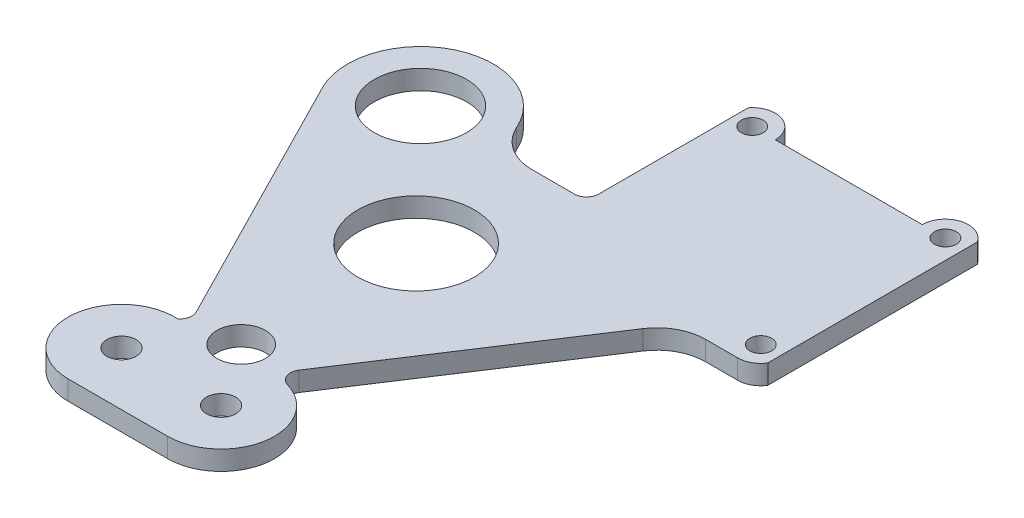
ISO-10303-21;
HEADER;
FILE_DESCRIPTION(('STEP AP214'),'2;1');
FILE_NAME('part.step','',(''),(''),'','','');
FILE_SCHEMA(('AUTOMOTIVE_DESIGN { 1 0 10303 214 1 1 1 1 }'));
ENDSEC;
DATA;
#1=APPLICATION_CONTEXT('core data for automotive mechanical design processes');
#2=APPLICATION_PROTOCOL_DEFINITION('international standard','automotive_design',2000,#1);
#3=PRODUCT_CONTEXT('',#1,'mechanical');
#4=PRODUCT('Part','Part','',(#3));
#5=PRODUCT_RELATED_PRODUCT_CATEGORY('part','',(#4));
#6=PRODUCT_DEFINITION_FORMATION('','',#4);
#7=PRODUCT_DEFINITION_CONTEXT('part definition',#1,'design');
#8=PRODUCT_DEFINITION('design','',#6,#7);
#9=PRODUCT_DEFINITION_SHAPE('','',#8);
#10=(LENGTH_UNIT() NAMED_UNIT(*) SI_UNIT(.MILLI.,.METRE.));
#11=(NAMED_UNIT(*) PLANE_ANGLE_UNIT() SI_UNIT($,.RADIAN.));
#12=(NAMED_UNIT(*) SI_UNIT($,.STERADIAN.) SOLID_ANGLE_UNIT());
#13=UNCERTAINTY_MEASURE_WITH_UNIT(LENGTH_MEASURE(1.E-05),#10,'distance_accuracy_value','');
#14=(GEOMETRIC_REPRESENTATION_CONTEXT(3) GLOBAL_UNCERTAINTY_ASSIGNED_CONTEXT((#13)) GLOBAL_UNIT_ASSIGNED_CONTEXT((#10,
#11,#12)) REPRESENTATION_CONTEXT('',''));
#15=CARTESIAN_POINT('',(0.,0.,0.));
#16=DIRECTION('',(0.,0.,1.));
#17=DIRECTION('',(1.,0.,0.));
#18=AXIS2_PLACEMENT_3D('',#15,#16,#17);
#19=CARTESIAN_POINT('',(-25.25,8.,72.));
#20=DIRECTION('',(0.,1.,0.));
#21=DIRECTION('',(0.,0.,1.));
#22=AXIS2_PLACEMENT_3D('',#19,#20,#21);
#23=PLANE('',#22);
#24=CARTESIAN_POINT('',(107.,8.,-34.9));
#25=DIRECTION('',(0.,1.,0.));
#26=DIRECTION('',(0.,0.,1.));
#27=AXIS2_PLACEMENT_3D('',#24,#25,#26);
#28=CIRCLE('',#27,4.50000000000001);
#29=CARTESIAN_POINT('',(107.,8.,-30.4));
#30=VERTEX_POINT('',#29);
#31=EDGE_CURVE('E447',#30,#30,#28,.T.);
#32=ORIENTED_EDGE('',*,*,#31,.F.);
#33=EDGE_LOOP('',(#32));
#34=FACE_BOUND('',#33,.T.);
#35=CARTESIAN_POINT('',(17.6217629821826,8.,97.9));
#36=DIRECTION('',(0.,1.,0.));
#37=DIRECTION('',(0.,0.,1.));
#38=AXIS2_PLACEMENT_3D('',#35,#36,#37);
#39=CIRCLE('',#38,6.00000000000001);
#40=CARTESIAN_POINT('',(17.6217629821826,8.,103.9));
#41=VERTEX_POINT('',#40);
#42=EDGE_CURVE('E459',#41,#41,#39,.T.);
#43=ORIENTED_EDGE('',*,*,#42,.F.);
#44=EDGE_LOOP('',(#43));
#45=FACE_BOUND('',#44,.T.);
#46=CARTESIAN_POINT('',(0.,8.,72.));
#47=DIRECTION('',(0.,1.,0.));
#48=DIRECTION('',(0.,0.,1.));
#49=AXIS2_PLACEMENT_3D('',#46,#47,#48);
#50=CIRCLE('',#49,10.);
#51=CARTESIAN_POINT('',(0.,8.,82.));
#52=VERTEX_POINT('',#51);
#53=EDGE_CURVE('E471',#52,#52,#50,.T.);
#54=ORIENTED_EDGE('',*,*,#53,.F.);
#55=EDGE_LOOP('',(#54));
#56=FACE_BOUND('',#55,.T.);
#57=CARTESIAN_POINT('',(0.,8.,0.));
#58=DIRECTION('',(0.,1.,0.));
#59=DIRECTION('',(0.,0.,1.));
#60=AXIS2_PLACEMENT_3D('',#57,#58,#59);
#61=CIRCLE('',#60,24.);
#62=CARTESIAN_POINT('',(0.,8.,24.));
#63=VERTEX_POINT('',#62);
#64=EDGE_CURVE('E181',#63,#63,#61,.T.);
#65=ORIENTED_EDGE('',*,*,#64,.F.);
#66=EDGE_LOOP('',(#65));
#67=FACE_BOUND('',#66,.T.);
#68=CARTESIAN_POINT('',(-25.25,8.,72.));
#69=DIRECTION('',(0.,-1.,0.));
#70=DIRECTION('',(0.,0.,1.));
#71=AXIS2_PLACEMENT_3D('',#68,#69,#70);
#72=CIRCLE('',#71,5.);
#73=CARTESIAN_POINT('',(-20.7953119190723,8.,69.7293714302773));
#74=VERTEX_POINT('',#73);
#75=CARTESIAN_POINT('',(-22.1634076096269,8.,75.9335667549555));
#76=VERTEX_POINT('',#75);
#77=EDGE_CURVE('E221',#74,#76,#72,.T.);
#78=ORIENTED_EDGE('',*,*,#77,.T.);
#79=CARTESIAN_POINT('',(-23.3782370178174,8.,97.9));
#80=DIRECTION('',(0.,1.,0.));
#81=DIRECTION('',(0.,0.,-1.));
#82=AXIS2_PLACEMENT_3D('',#79,#80,#81);
#83=CIRCLE('',#82,22.);
#84=CARTESIAN_POINT('',(-23.3782370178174,8.,119.9));
#85=VERTEX_POINT('',#84);
#86=EDGE_CURVE('E176',#76,#85,#83,.T.);
#87=ORIENTED_EDGE('',*,*,#86,.T.);
#88=DIRECTION('',(1.,0.,0.));
#89=VECTOR('',#88,1.);
#90=CARTESIAN_POINT('',(17.6217629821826,8.,119.9));
#91=LINE('',#90,#89);
#92=CARTESIAN_POINT('',(17.6217629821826,8.,119.9));
#93=VERTEX_POINT('',#92);
#94=EDGE_CURVE('E224',#85,#93,#91,.T.);
#95=ORIENTED_EDGE('',*,*,#94,.T.);
#96=CARTESIAN_POINT('',(17.6217629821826,8.,97.9));
#97=DIRECTION('',(0.,1.,0.));
#98=DIRECTION('',(0.,0.,-1.));
#99=AXIS2_PLACEMENT_3D('',#96,#97,#98);
#100=CIRCLE('',#99,22.);
#101=CARTESIAN_POINT('',(23.837363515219,8.,76.7962962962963));
#102=VERTEX_POINT('',#101);
#103=EDGE_CURVE('E226',#93,#102,#100,.T.);
#104=ORIENTED_EDGE('',*,*,#103,.T.);
#105=CARTESIAN_POINT('',(25.25,8.,72.));
#106=DIRECTION('',(0.,-1.,0.));
#107=DIRECTION('',(0.,0.,1.));
#108=AXIS2_PLACEMENT_3D('',#105,#106,#107);
#109=CIRCLE('',#108,5.);
#110=CARTESIAN_POINT('',(21.0656809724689,8.,69.2629442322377));
#111=VERTEX_POINT('',#110);
#112=EDGE_CURVE('E228',#102,#111,#109,.T.);
#113=ORIENTED_EDGE('',*,*,#112,.T.);
#114=DIRECTION('',(0.547411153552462,0.,-0.836863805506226));
#115=VECTOR('',#114,1.);
#116=CARTESIAN_POINT('',(77.0658419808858,8.,-16.3482230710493));
#117=LINE('',#116,#115);
#118=CARTESIAN_POINT('',(77.0658419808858,8.,-16.3482230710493));
#119=VERTEX_POINT('',#118);
#120=EDGE_CURVE('E230',#111,#119,#117,.T.);
#121=ORIENTED_EDGE('',*,*,#120,.T.);
#122=CARTESIAN_POINT('',(93.8031180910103,8.,-5.40000000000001));
#123=DIRECTION('',(0.,-1.,0.));
#124=DIRECTION('',(0.,0.,1.));
#125=AXIS2_PLACEMENT_3D('',#122,#123,#124);
#126=CIRCLE('',#125,20.);
#127=CARTESIAN_POINT('',(93.8031180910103,8.,-25.4));
#128=VERTEX_POINT('',#127);
#129=EDGE_CURVE('E232',#119,#128,#126,.T.);
#130=ORIENTED_EDGE('',*,*,#129,.T.);
#131=DIRECTION('',(1.,0.,0.));
#132=VECTOR('',#131,1.);
#133=CARTESIAN_POINT('',(107.,8.,-25.4));
#134=LINE('',#133,#132);
#135=CARTESIAN_POINT('',(107.,8.,-25.4));
#136=VERTEX_POINT('',#135);
#137=EDGE_CURVE('E234',#128,#136,#134,.T.);
#138=ORIENTED_EDGE('',*,*,#137,.T.);
#139=CARTESIAN_POINT('',(107.,8.,-34.9));
#140=DIRECTION('',(0.,1.,0.));
#141=DIRECTION('',(0.,0.,-1.));
#142=AXIS2_PLACEMENT_3D('',#139,#140,#141);
#143=CIRCLE('',#142,9.5);
#144=CARTESIAN_POINT('',(115.,8.,-29.7765246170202));
#145=VERTEX_POINT('',#144);
#146=EDGE_CURVE('E236',#136,#145,#143,.T.);
#147=ORIENTED_EDGE('',*,*,#146,.T.);
#148=DIRECTION('',(0.,0.,-1.));
#149=VECTOR('',#148,1.);
#150=CARTESIAN_POINT('',(115.,8.,-116.02347538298));
#151=LINE('',#150,#149);
#152=CARTESIAN_POINT('',(115.,8.,-116.02347538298));
#153=VERTEX_POINT('',#152);
#154=EDGE_CURVE('E238',#145,#153,#151,.T.);
#155=ORIENTED_EDGE('',*,*,#154,.T.);
#156=CARTESIAN_POINT('',(107.,8.,-110.9));
#157=DIRECTION('',(0.,1.,0.));
#158=DIRECTION('',(0.,0.,-1.));
#159=AXIS2_PLACEMENT_3D('',#156,#157,#158);
#160=CIRCLE('',#159,9.5);
#161=CARTESIAN_POINT('',(97.5,8.,-110.9));
#162=VERTEX_POINT('',#161);
#163=EDGE_CURVE('E240',#153,#162,#160,.T.);
#164=ORIENTED_EDGE('',*,*,#163,.T.);
#165=DIRECTION('',(-1.,0.,0.));
#166=VECTOR('',#165,1.);
#167=CARTESIAN_POINT('',(37.,8.,-110.9));
#168=LINE('',#167,#166);
#169=CARTESIAN_POINT('',(37.,8.,-110.9));
#170=VERTEX_POINT('',#169);
#171=EDGE_CURVE('E242',#162,#170,#168,.T.);
#172=ORIENTED_EDGE('',*,*,#171,.T.);
#173=CARTESIAN_POINT('',(27.5,8.,-110.9));
#174=DIRECTION('',(0.,1.,0.));
#175=DIRECTION('',(0.,0.,-1.));
#176=AXIS2_PLACEMENT_3D('',#173,#174,#175);
#177=CIRCLE('',#176,9.5);
#178=CARTESIAN_POINT('',(20.,8.,-116.730951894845));
#179=VERTEX_POINT('',#178);
#180=EDGE_CURVE('E244',#170,#179,#177,.T.);
#181=ORIENTED_EDGE('',*,*,#180,.T.);
#182=DIRECTION('',(0.,0.,1.));
#183=VECTOR('',#182,1.);
#184=CARTESIAN_POINT('',(20.,8.,-55.1857092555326));
#185=LINE('',#184,#183);
#186=CARTESIAN_POINT('',(20.,8.,-55.1857092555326));
#187=VERTEX_POINT('',#186);
#188=EDGE_CURVE('E246',#179,#187,#185,.T.);
#189=ORIENTED_EDGE('',*,*,#188,.T.);
#190=CARTESIAN_POINT('',(15.,8.,-55.1857092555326));
#191=DIRECTION('',(0.,-1.,0.));
#192=DIRECTION('',(0.,0.,1.));
#193=AXIS2_PLACEMENT_3D('',#190,#191,#192);
#194=CIRCLE('',#193,5.);
#195=CARTESIAN_POINT('',(15.,8.,-50.1857092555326));
#196=VERTEX_POINT('',#195);
#197=EDGE_CURVE('E248',#187,#196,#194,.T.);
#198=ORIENTED_EDGE('',*,*,#197,.T.);
#199=DIRECTION('',(-1.,0.,0.));
#200=VECTOR('',#199,1.);
#201=CARTESIAN_POINT('',(-2.4,8.,-50.1857092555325));
#202=LINE('',#201,#200);
#203=CARTESIAN_POINT('',(-2.39999999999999,8.,-50.1857092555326));
#204=VERTEX_POINT('',#203);
#205=EDGE_CURVE('E250',#196,#204,#202,.T.);
#206=ORIENTED_EDGE('',*,*,#205,.T.);
#207=CARTESIAN_POINT('',(-2.4,8.,-70.1857092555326));
#208=DIRECTION('',(0.,-1.,0.));
#209=DIRECTION('',(0.,0.,-1.));
#210=AXIS2_PLACEMENT_3D('',#207,#208,#209);
#211=CIRCLE('',#210,20.);
#212=CARTESIAN_POINT('',(-20.68,8.,-62.0714255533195));
#213=VERTEX_POINT('',#212);
#214=EDGE_CURVE('E252',#204,#213,#211,.T.);
#215=ORIENTED_EDGE('',*,*,#214,.T.);
#216=CARTESIAN_POINT('',(-48.1,8.,-49.9));
#217=DIRECTION('',(0.,1.,0.));
#218=DIRECTION('',(0.,0.,-1.));
#219=AXIS2_PLACEMENT_3D('',#216,#217,#218);
#220=CIRCLE('',#219,30.);
#221=CARTESIAN_POINT('',(-74.828128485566,8.,-36.2762285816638));
#222=VERTEX_POINT('',#221);
#223=EDGE_CURVE('E51',#213,#222,#220,.T.);
#224=ORIENTED_EDGE('',*,*,#223,.T.);
#225=DIRECTION('',(0.45412571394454,0.,0.890937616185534));
#226=VECTOR('',#225,1.);
#227=CARTESIAN_POINT('',(-20.7953119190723,8.,69.7293714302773));
#228=LINE('',#227,#226);
#229=EDGE_CURVE('E46',#222,#74,#228,.T.);
#230=ORIENTED_EDGE('',*,*,#229,.T.);
#231=EDGE_LOOP('',(#78,#87,#95,#104,#113,#121,#130,#138,#147,#155,#164,#172,#181,#189,#198,#206,
#215,#224,#230));
#232=FACE_BOUND('',#231,.T.);
#233=CARTESIAN_POINT('',(-48.1,8.,-49.9));
#234=DIRECTION('',(0.,1.,0.));
#235=DIRECTION('',(0.,0.,1.));
#236=AXIS2_PLACEMENT_3D('',#233,#234,#235);
#237=CIRCLE('',#236,19.);
#238=CARTESIAN_POINT('',(-48.1,8.,-30.9));
#239=VERTEX_POINT('',#238);
#240=EDGE_CURVE('E477',#239,#239,#237,.T.);
#241=ORIENTED_EDGE('',*,*,#240,.F.);
#242=EDGE_LOOP('',(#241));
#243=FACE_BOUND('',#242,.T.);
#244=CARTESIAN_POINT('',(-23.3782370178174,8.,97.9));
#245=DIRECTION('',(0.,1.,0.));
#246=DIRECTION('',(0.,0.,1.));
#247=AXIS2_PLACEMENT_3D('',#244,#245,#246);
#248=CIRCLE('',#247,6.00000000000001);
#249=CARTESIAN_POINT('',(-23.3782370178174,8.,103.9));
#250=VERTEX_POINT('',#249);
#251=EDGE_CURVE('E465',#250,#250,#248,.T.);
#252=ORIENTED_EDGE('',*,*,#251,.F.);
#253=EDGE_LOOP('',(#252));
#254=FACE_BOUND('',#253,.T.);
#255=CARTESIAN_POINT('',(107.,8.,-110.9));
#256=DIRECTION('',(0.,1.,0.));
#257=DIRECTION('',(0.,0.,1.));
#258=AXIS2_PLACEMENT_3D('',#255,#256,#257);
#259=CIRCLE('',#258,4.50000000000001);
#260=CARTESIAN_POINT('',(107.,8.,-106.4));
#261=VERTEX_POINT('',#260);
#262=EDGE_CURVE('E453',#261,#261,#259,.T.);
#263=ORIENTED_EDGE('',*,*,#262,.F.);
#264=EDGE_LOOP('',(#263));
#265=FACE_BOUND('',#264,.T.);
#266=CARTESIAN_POINT('',(27.5,8.,-110.9));
#267=DIRECTION('',(0.,1.,0.));
#268=DIRECTION('',(0.,0.,1.));
#269=AXIS2_PLACEMENT_3D('',#266,#267,#268);
#270=CIRCLE('',#269,4.50000000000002);
#271=CARTESIAN_POINT('',(27.5,8.,-106.4));
#272=VERTEX_POINT('',#271);
#273=EDGE_CURVE('E436',#272,#272,#270,.T.);
#274=ORIENTED_EDGE('',*,*,#273,.F.);
#275=EDGE_LOOP('',(#274));
#276=FACE_BOUND('',#275,.T.);
#277=ADVANCED_FACE('F31',(#34,#45,#56,#67,#232,#243,#254,#265,#276),#23,.T.);
#278=CARTESIAN_POINT('',(-25.25,0.,72.));
#279=DIRECTION('',(0.,1.,0.));
#280=DIRECTION('',(0.,0.,1.));
#281=AXIS2_PLACEMENT_3D('',#278,#279,#280);
#282=PLANE('',#281);
#283=CARTESIAN_POINT('',(107.,0.,-34.9));
#284=DIRECTION('',(0.,1.,0.));
#285=DIRECTION('',(0.,0.,1.));
#286=AXIS2_PLACEMENT_3D('',#283,#284,#285);
#287=CIRCLE('',#286,4.50000000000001);
#288=CARTESIAN_POINT('',(107.,0.,-30.4));
#289=VERTEX_POINT('',#288);
#290=EDGE_CURVE('E442',#289,#289,#287,.T.);
#291=ORIENTED_EDGE('',*,*,#290,.T.);
#292=EDGE_LOOP('',(#291));
#293=FACE_BOUND('',#292,.T.);
#294=CARTESIAN_POINT('',(17.6217629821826,0.,97.9));
#295=DIRECTION('',(0.,1.,0.));
#296=DIRECTION('',(0.,0.,1.));
#297=AXIS2_PLACEMENT_3D('',#294,#295,#296);
#298=CIRCLE('',#297,6.00000000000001);
#299=CARTESIAN_POINT('',(17.6217629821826,0.,103.9));
#300=VERTEX_POINT('',#299);
#301=EDGE_CURVE('E456',#300,#300,#298,.T.);
#302=ORIENTED_EDGE('',*,*,#301,.T.);
#303=EDGE_LOOP('',(#302));
#304=FACE_BOUND('',#303,.T.);
#305=CARTESIAN_POINT('',(0.,0.,72.));
#306=DIRECTION('',(0.,1.,0.));
#307=DIRECTION('',(0.,0.,1.));
#308=AXIS2_PLACEMENT_3D('',#305,#306,#307);
#309=CIRCLE('',#308,10.);
#310=CARTESIAN_POINT('',(0.,0.,82.));
#311=VERTEX_POINT('',#310);
#312=EDGE_CURVE('E468',#311,#311,#309,.T.);
#313=ORIENTED_EDGE('',*,*,#312,.T.);
#314=EDGE_LOOP('',(#313));
#315=FACE_BOUND('',#314,.T.);
#316=CARTESIAN_POINT('',(0.,0.,0.));
#317=DIRECTION('',(0.,1.,0.));
#318=DIRECTION('',(0.,0.,1.));
#319=AXIS2_PLACEMENT_3D('',#316,#317,#318);
#320=CIRCLE('',#319,24.);
#321=CARTESIAN_POINT('',(0.,0.,24.));
#322=VERTEX_POINT('',#321);
#323=EDGE_CURVE('E184',#322,#322,#320,.T.);
#324=ORIENTED_EDGE('',*,*,#323,.T.);
#325=EDGE_LOOP('',(#324));
#326=FACE_BOUND('',#325,.T.);
#327=CARTESIAN_POINT('',(-25.25,0.,72.));
#328=DIRECTION('',(0.,-1.,0.));
#329=DIRECTION('',(0.,0.,1.));
#330=AXIS2_PLACEMENT_3D('',#327,#328,#329);
#331=CIRCLE('',#330,5.);
#332=CARTESIAN_POINT('',(-20.7953119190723,0.,69.7293714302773));
#333=VERTEX_POINT('',#332);
#334=CARTESIAN_POINT('',(-22.1634076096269,0.,75.9335667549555));
#335=VERTEX_POINT('',#334);
#336=EDGE_CURVE('E167',#333,#335,#331,.T.);
#337=ORIENTED_EDGE('',*,*,#336,.F.);
#338=DIRECTION('',(0.45412571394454,0.,0.890937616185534));
#339=VECTOR('',#338,1.);
#340=CARTESIAN_POINT('',(-20.7953119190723,0.,69.7293714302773));
#341=LINE('',#340,#339);
#342=CARTESIAN_POINT('',(-74.828128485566,0.,-36.2762285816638));
#343=VERTEX_POINT('',#342);
#344=EDGE_CURVE('E219',#343,#333,#341,.T.);
#345=ORIENTED_EDGE('',*,*,#344,.F.);
#346=CARTESIAN_POINT('',(-48.1,0.,-49.9));
#347=DIRECTION('',(0.,1.,0.));
#348=DIRECTION('',(0.,0.,-1.));
#349=AXIS2_PLACEMENT_3D('',#346,#347,#348);
#350=CIRCLE('',#349,30.);
#351=CARTESIAN_POINT('',(-20.68,0.,-62.0714255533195));
#352=VERTEX_POINT('',#351);
#353=EDGE_CURVE('E217',#352,#343,#350,.T.);
#354=ORIENTED_EDGE('',*,*,#353,.F.);
#355=CARTESIAN_POINT('',(-2.4,0.,-70.1857092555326));
#356=DIRECTION('',(0.,-1.,0.));
#357=DIRECTION('',(0.,0.,-1.));
#358=AXIS2_PLACEMENT_3D('',#355,#356,#357);
#359=CIRCLE('',#358,20.);
#360=CARTESIAN_POINT('',(-2.39999999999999,0.,-50.1857092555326));
#361=VERTEX_POINT('',#360);
#362=EDGE_CURVE('E215',#361,#352,#359,.T.);
#363=ORIENTED_EDGE('',*,*,#362,.F.);
#364=DIRECTION('',(-1.,0.,0.));
#365=VECTOR('',#364,1.);
#366=CARTESIAN_POINT('',(-2.4,0.,-50.1857092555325));
#367=LINE('',#366,#365);
#368=CARTESIAN_POINT('',(15.,0.,-50.1857092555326));
#369=VERTEX_POINT('',#368);
#370=EDGE_CURVE('E213',#369,#361,#367,.T.);
#371=ORIENTED_EDGE('',*,*,#370,.F.);
#372=CARTESIAN_POINT('',(15.,0.,-55.1857092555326));
#373=DIRECTION('',(0.,-1.,0.));
#374=DIRECTION('',(0.,0.,1.));
#375=AXIS2_PLACEMENT_3D('',#372,#373,#374);
#376=CIRCLE('',#375,5.);
#377=CARTESIAN_POINT('',(20.,0.,-55.1857092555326));
#378=VERTEX_POINT('',#377);
#379=EDGE_CURVE('E211',#378,#369,#376,.T.);
#380=ORIENTED_EDGE('',*,*,#379,.F.);
#381=DIRECTION('',(0.,0.,1.));
#382=VECTOR('',#381,1.);
#383=CARTESIAN_POINT('',(20.,0.,-55.1857092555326));
#384=LINE('',#383,#382);
#385=CARTESIAN_POINT('',(20.,0.,-116.730951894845));
#386=VERTEX_POINT('',#385);
#387=EDGE_CURVE('E209',#386,#378,#384,.T.);
#388=ORIENTED_EDGE('',*,*,#387,.F.);
#389=CARTESIAN_POINT('',(27.5,0.,-110.9));
#390=DIRECTION('',(0.,1.,0.));
#391=DIRECTION('',(0.,0.,-1.));
#392=AXIS2_PLACEMENT_3D('',#389,#390,#391);
#393=CIRCLE('',#392,9.5);
#394=CARTESIAN_POINT('',(37.,0.,-110.9));
#395=VERTEX_POINT('',#394);
#396=EDGE_CURVE('E207',#395,#386,#393,.T.);
#397=ORIENTED_EDGE('',*,*,#396,.F.);
#398=DIRECTION('',(-1.,0.,0.));
#399=VECTOR('',#398,1.);
#400=CARTESIAN_POINT('',(37.,0.,-110.9));
#401=LINE('',#400,#399);
#402=CARTESIAN_POINT('',(97.5,0.,-110.9));
#403=VERTEX_POINT('',#402);
#404=EDGE_CURVE('E205',#403,#395,#401,.T.);
#405=ORIENTED_EDGE('',*,*,#404,.F.);
#406=CARTESIAN_POINT('',(107.,0.,-110.9));
#407=DIRECTION('',(0.,1.,0.));
#408=DIRECTION('',(0.,0.,-1.));
#409=AXIS2_PLACEMENT_3D('',#406,#407,#408);
#410=CIRCLE('',#409,9.5);
#411=CARTESIAN_POINT('',(115.,0.,-116.02347538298));
#412=VERTEX_POINT('',#411);
#413=EDGE_CURVE('E203',#412,#403,#410,.T.);
#414=ORIENTED_EDGE('',*,*,#413,.F.);
#415=DIRECTION('',(0.,0.,-1.));
#416=VECTOR('',#415,1.);
#417=CARTESIAN_POINT('',(115.,0.,-116.02347538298));
#418=LINE('',#417,#416);
#419=CARTESIAN_POINT('',(115.,0.,-29.7765246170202));
#420=VERTEX_POINT('',#419);
#421=EDGE_CURVE('E201',#420,#412,#418,.T.);
#422=ORIENTED_EDGE('',*,*,#421,.F.);
#423=CARTESIAN_POINT('',(107.,0.,-34.9));
#424=DIRECTION('',(0.,1.,0.));
#425=DIRECTION('',(0.,0.,-1.));
#426=AXIS2_PLACEMENT_3D('',#423,#424,#425);
#427=CIRCLE('',#426,9.5);
#428=CARTESIAN_POINT('',(107.,0.,-25.4));
#429=VERTEX_POINT('',#428);
#430=EDGE_CURVE('E199',#429,#420,#427,.T.);
#431=ORIENTED_EDGE('',*,*,#430,.F.);
#432=DIRECTION('',(1.,0.,0.));
#433=VECTOR('',#432,1.);
#434=CARTESIAN_POINT('',(107.,0.,-25.4));
#435=LINE('',#434,#433);
#436=CARTESIAN_POINT('',(93.8031180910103,0.,-25.4));
#437=VERTEX_POINT('',#436);
#438=EDGE_CURVE('E197',#437,#429,#435,.T.);
#439=ORIENTED_EDGE('',*,*,#438,.F.);
#440=CARTESIAN_POINT('',(93.8031180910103,0.,-5.40000000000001));
#441=DIRECTION('',(0.,-1.,0.));
#442=DIRECTION('',(0.,0.,1.));
#443=AXIS2_PLACEMENT_3D('',#440,#441,#442);
#444=CIRCLE('',#443,20.);
#445=CARTESIAN_POINT('',(77.0658419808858,0.,-16.3482230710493));
#446=VERTEX_POINT('',#445);
#447=EDGE_CURVE('E195',#446,#437,#444,.T.);
#448=ORIENTED_EDGE('',*,*,#447,.F.);
#449=DIRECTION('',(0.547411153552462,0.,-0.836863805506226));
#450=VECTOR('',#449,1.);
#451=CARTESIAN_POINT('',(77.0658419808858,0.,-16.3482230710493));
#452=LINE('',#451,#450);
#453=CARTESIAN_POINT('',(21.0656809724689,0.,69.2629442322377));
#454=VERTEX_POINT('',#453);
#455=EDGE_CURVE('E193',#454,#446,#452,.T.);
#456=ORIENTED_EDGE('',*,*,#455,.F.);
#457=CARTESIAN_POINT('',(25.25,0.,72.));
#458=DIRECTION('',(0.,-1.,0.));
#459=DIRECTION('',(0.,0.,1.));
#460=AXIS2_PLACEMENT_3D('',#457,#458,#459);
#461=CIRCLE('',#460,5.);
#462=CARTESIAN_POINT('',(23.837363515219,0.,76.7962962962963));
#463=VERTEX_POINT('',#462);
#464=EDGE_CURVE('E191',#463,#454,#461,.T.);
#465=ORIENTED_EDGE('',*,*,#464,.F.);
#466=CARTESIAN_POINT('',(17.6217629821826,0.,97.9));
#467=DIRECTION('',(0.,1.,0.));
#468=DIRECTION('',(0.,0.,-1.));
#469=AXIS2_PLACEMENT_3D('',#466,#467,#468);
#470=CIRCLE('',#469,22.);
#471=CARTESIAN_POINT('',(17.6217629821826,0.,119.9));
#472=VERTEX_POINT('',#471);
#473=EDGE_CURVE('E189',#472,#463,#470,.T.);
#474=ORIENTED_EDGE('',*,*,#473,.F.);
#475=DIRECTION('',(1.,0.,0.));
#476=VECTOR('',#475,1.);
#477=CARTESIAN_POINT('',(17.6217629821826,0.,119.9));
#478=LINE('',#477,#476);
#479=CARTESIAN_POINT('',(-23.3782370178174,0.,119.9));
#480=VERTEX_POINT('',#479);
#481=EDGE_CURVE('E169',#480,#472,#478,.T.);
#482=ORIENTED_EDGE('',*,*,#481,.F.);
#483=CARTESIAN_POINT('',(-23.3782370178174,0.,97.9));
#484=DIRECTION('',(0.,1.,0.));
#485=DIRECTION('',(0.,0.,-1.));
#486=AXIS2_PLACEMENT_3D('',#483,#484,#485);
#487=CIRCLE('',#486,22.);
#488=EDGE_CURVE('E162',#335,#480,#487,.T.);
#489=ORIENTED_EDGE('',*,*,#488,.F.);
#490=EDGE_LOOP('',(#337,#345,#354,#363,#371,#380,#388,#397,#405,#414,#422,#431,#439,#448,#456,
#465,#474,#482,#489));
#491=FACE_BOUND('',#490,.T.);
#492=CARTESIAN_POINT('',(-48.1,0.,-49.9));
#493=DIRECTION('',(0.,1.,0.));
#494=DIRECTION('',(0.,0.,1.));
#495=AXIS2_PLACEMENT_3D('',#492,#493,#494);
#496=CIRCLE('',#495,19.);
#497=CARTESIAN_POINT('',(-48.1,0.,-30.9));
#498=VERTEX_POINT('',#497);
#499=EDGE_CURVE('E474',#498,#498,#496,.T.);
#500=ORIENTED_EDGE('',*,*,#499,.T.);
#501=EDGE_LOOP('',(#500));
#502=FACE_BOUND('',#501,.T.);
#503=CARTESIAN_POINT('',(-23.3782370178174,0.,97.9));
#504=DIRECTION('',(0.,1.,0.));
#505=DIRECTION('',(0.,0.,1.));
#506=AXIS2_PLACEMENT_3D('',#503,#504,#505);
#507=CIRCLE('',#506,6.00000000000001);
#508=CARTESIAN_POINT('',(-23.3782370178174,0.,103.9));
#509=VERTEX_POINT('',#508);
#510=EDGE_CURVE('E462',#509,#509,#507,.T.);
#511=ORIENTED_EDGE('',*,*,#510,.T.);
#512=EDGE_LOOP('',(#511));
#513=FACE_BOUND('',#512,.T.);
#514=CARTESIAN_POINT('',(107.,0.,-110.9));
#515=DIRECTION('',(0.,1.,0.));
#516=DIRECTION('',(0.,0.,1.));
#517=AXIS2_PLACEMENT_3D('',#514,#515,#516);
#518=CIRCLE('',#517,4.50000000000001);
#519=CARTESIAN_POINT('',(107.,0.,-106.4));
#520=VERTEX_POINT('',#519);
#521=EDGE_CURVE('E450',#520,#520,#518,.T.);
#522=ORIENTED_EDGE('',*,*,#521,.T.);
#523=EDGE_LOOP('',(#522));
#524=FACE_BOUND('',#523,.T.);
#525=CARTESIAN_POINT('',(27.5,0.,-110.9));
#526=DIRECTION('',(0.,1.,0.));
#527=DIRECTION('',(0.,0.,1.));
#528=AXIS2_PLACEMENT_3D('',#525,#526,#527);
#529=CIRCLE('',#528,4.50000000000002);
#530=CARTESIAN_POINT('',(27.5,0.,-106.4));
#531=VERTEX_POINT('',#530);
#532=EDGE_CURVE('E439',#531,#531,#529,.T.);
#533=ORIENTED_EDGE('',*,*,#532,.T.);
#534=EDGE_LOOP('',(#533));
#535=FACE_BOUND('',#534,.T.);
#536=ADVANCED_FACE('F163',(#293,#304,#315,#326,#491,#502,#513,#524,#535),#282,.F.);
#537=CARTESIAN_POINT('',(-25.25,8.,72.));
#538=DIRECTION('',(0.,-1.,0.));
#539=DIRECTION('',(0.,0.,-1.));
#540=AXIS2_PLACEMENT_3D('',#537,#538,#539);
#541=CYLINDRICAL_SURFACE('',#540,5.);
#542=ORIENTED_EDGE('',*,*,#336,.T.);
#543=DIRECTION('',(0.,-1.,0.));
#544=VECTOR('',#543,1.);
#545=CARTESIAN_POINT('',(-22.1634076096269,8.,75.9335667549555));
#546=LINE('',#545,#544);
#547=EDGE_CURVE('E11',#76,#335,#546,.T.);
#548=ORIENTED_EDGE('',*,*,#547,.F.);
#549=ORIENTED_EDGE('',*,*,#77,.F.);
#550=DIRECTION('',(0.,-1.,0.));
#551=VECTOR('',#550,1.);
#552=CARTESIAN_POINT('',(-20.7953119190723,8.,69.7293714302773));
#553=LINE('',#552,#551);
#554=EDGE_CURVE('E180',#74,#333,#553,.T.);
#555=ORIENTED_EDGE('',*,*,#554,.T.);
#556=EDGE_LOOP('',(#542,#548,#549,#555));
#557=FACE_BOUND('',#556,.T.);
#558=ADVANCED_FACE('F33',(#557),#541,.F.);
#559=CARTESIAN_POINT('',(-23.3782370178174,8.,97.9));
#560=DIRECTION('',(0.,-1.,0.));
#561=DIRECTION('',(0.,0.,-1.));
#562=AXIS2_PLACEMENT_3D('',#559,#560,#561);
#563=CYLINDRICAL_SURFACE('',#562,22.);
#564=ORIENTED_EDGE('',*,*,#488,.T.);
#565=DIRECTION('',(0.,-1.,0.));
#566=VECTOR('',#565,1.);
#567=CARTESIAN_POINT('',(-23.3782370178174,8.,119.9));
#568=LINE('',#567,#566);
#569=EDGE_CURVE('E39',#85,#480,#568,.T.);
#570=ORIENTED_EDGE('',*,*,#569,.F.);
#571=ORIENTED_EDGE('',*,*,#86,.F.);
#572=ORIENTED_EDGE('',*,*,#547,.T.);
#573=EDGE_LOOP('',(#564,#570,#571,#572));
#574=FACE_BOUND('',#573,.T.);
#575=ADVANCED_FACE('F175',(#574),#563,.T.);
#576=CARTESIAN_POINT('',(17.6217629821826,8.,119.9));
#577=DIRECTION('',(0.,0.,-1.));
#578=DIRECTION('',(-1.,0.,0.));
#579=AXIS2_PLACEMENT_3D('',#576,#577,#578);
#580=PLANE('',#579);
#581=ORIENTED_EDGE('',*,*,#481,.T.);
#582=DIRECTION('',(0.,-1.,0.));
#583=VECTOR('',#582,1.);
#584=CARTESIAN_POINT('',(17.6217629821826,8.,119.9));
#585=LINE('',#584,#583);
#586=EDGE_CURVE('E302',#93,#472,#585,.T.);
#587=ORIENTED_EDGE('',*,*,#586,.F.);
#588=ORIENTED_EDGE('',*,*,#94,.F.);
#589=ORIENTED_EDGE('',*,*,#569,.T.);
#590=EDGE_LOOP('',(#581,#587,#588,#589));
#591=FACE_BOUND('',#590,.T.);
#592=ADVANCED_FACE('F306',(#591),#580,.F.);
#593=CARTESIAN_POINT('',(17.6217629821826,8.,97.9));
#594=DIRECTION('',(0.,-1.,0.));
#595=DIRECTION('',(0.,0.,-1.));
#596=AXIS2_PLACEMENT_3D('',#593,#594,#595);
#597=CYLINDRICAL_SURFACE('',#596,22.);
#598=ORIENTED_EDGE('',*,*,#473,.T.);
#599=DIRECTION('',(0.,-1.,0.));
#600=VECTOR('',#599,1.);
#601=CARTESIAN_POINT('',(23.837363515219,8.,76.7962962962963));
#602=LINE('',#601,#600);
#603=EDGE_CURVE('E299',#102,#463,#602,.T.);
#604=ORIENTED_EDGE('',*,*,#603,.F.);
#605=ORIENTED_EDGE('',*,*,#103,.F.);
#606=ORIENTED_EDGE('',*,*,#586,.T.);
#607=EDGE_LOOP('',(#598,#604,#605,#606));
#608=FACE_BOUND('',#607,.T.);
#609=ADVANCED_FACE('F314',(#608),#597,.T.);
#610=CARTESIAN_POINT('',(25.25,8.,72.));
#611=DIRECTION('',(0.,-1.,0.));
#612=DIRECTION('',(0.,0.,-1.));
#613=AXIS2_PLACEMENT_3D('',#610,#611,#612);
#614=CYLINDRICAL_SURFACE('',#613,5.);
#615=ORIENTED_EDGE('',*,*,#464,.T.);
#616=DIRECTION('',(0.,-1.,0.));
#617=VECTOR('',#616,1.);
#618=CARTESIAN_POINT('',(21.0656809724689,8.,69.2629442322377));
#619=LINE('',#618,#617);
#620=EDGE_CURVE('E296',#111,#454,#619,.T.);
#621=ORIENTED_EDGE('',*,*,#620,.F.);
#622=ORIENTED_EDGE('',*,*,#112,.F.);
#623=ORIENTED_EDGE('',*,*,#603,.T.);
#624=EDGE_LOOP('',(#615,#621,#622,#623));
#625=FACE_BOUND('',#624,.T.);
#626=ADVANCED_FACE('F317',(#625),#614,.F.);
#627=CARTESIAN_POINT('',(77.0658419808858,8.,-16.3482230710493));
#628=DIRECTION('',(-0.836863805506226,0.,-0.547411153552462));
#629=DIRECTION('',(-0.547411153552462,0.,0.836863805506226));
#630=AXIS2_PLACEMENT_3D('',#627,#628,#629);
#631=PLANE('',#630);
#632=ORIENTED_EDGE('',*,*,#455,.T.);
#633=DIRECTION('',(0.,-1.,0.));
#634=VECTOR('',#633,1.);
#635=CARTESIAN_POINT('',(77.0658419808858,8.,-16.3482230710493));
#636=LINE('',#635,#634);
#637=EDGE_CURVE('E293',#119,#446,#636,.T.);
#638=ORIENTED_EDGE('',*,*,#637,.F.);
#639=ORIENTED_EDGE('',*,*,#120,.F.);
#640=ORIENTED_EDGE('',*,*,#620,.T.);
#641=EDGE_LOOP('',(#632,#638,#639,#640));
#642=FACE_BOUND('',#641,.T.);
#643=ADVANCED_FACE('F322',(#642),#631,.F.);
#644=CARTESIAN_POINT('',(93.8031180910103,8.,-5.40000000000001));
#645=DIRECTION('',(0.,-1.,0.));
#646=DIRECTION('',(0.,0.,-1.));
#647=AXIS2_PLACEMENT_3D('',#644,#645,#646);
#648=CYLINDRICAL_SURFACE('',#647,20.);
#649=ORIENTED_EDGE('',*,*,#447,.T.);
#650=DIRECTION('',(0.,-1.,0.));
#651=VECTOR('',#650,1.);
#652=CARTESIAN_POINT('',(93.8031180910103,8.,-25.4));
#653=LINE('',#652,#651);
#654=EDGE_CURVE('E290',#128,#437,#653,.T.);
#655=ORIENTED_EDGE('',*,*,#654,.F.);
#656=ORIENTED_EDGE('',*,*,#129,.F.);
#657=ORIENTED_EDGE('',*,*,#637,.T.);
#658=EDGE_LOOP('',(#649,#655,#656,#657));
#659=FACE_BOUND('',#658,.T.);
#660=ADVANCED_FACE('F328',(#659),#648,.F.);
#661=CARTESIAN_POINT('',(107.,8.,-25.4));
#662=DIRECTION('',(0.,0.,-1.));
#663=DIRECTION('',(-1.,0.,0.));
#664=AXIS2_PLACEMENT_3D('',#661,#662,#663);
#665=PLANE('',#664);
#666=ORIENTED_EDGE('',*,*,#438,.T.);
#667=DIRECTION('',(0.,-1.,0.));
#668=VECTOR('',#667,1.);
#669=CARTESIAN_POINT('',(107.,8.,-25.4));
#670=LINE('',#669,#668);
#671=EDGE_CURVE('E287',#136,#429,#670,.T.);
#672=ORIENTED_EDGE('',*,*,#671,.F.);
#673=ORIENTED_EDGE('',*,*,#137,.F.);
#674=ORIENTED_EDGE('',*,*,#654,.T.);
#675=EDGE_LOOP('',(#666,#672,#673,#674));
#676=FACE_BOUND('',#675,.T.);
#677=ADVANCED_FACE('F332',(#676),#665,.F.);
#678=CARTESIAN_POINT('',(107.,8.,-34.9));
#679=DIRECTION('',(0.,-1.,0.));
#680=DIRECTION('',(0.,0.,-1.));
#681=AXIS2_PLACEMENT_3D('',#678,#679,#680);
#682=CYLINDRICAL_SURFACE('',#681,9.5);
#683=ORIENTED_EDGE('',*,*,#430,.T.);
#684=DIRECTION('',(0.,-1.,0.));
#685=VECTOR('',#684,1.);
#686=CARTESIAN_POINT('',(115.,8.,-29.7765246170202));
#687=LINE('',#686,#685);
#688=EDGE_CURVE('E284',#145,#420,#687,.T.);
#689=ORIENTED_EDGE('',*,*,#688,.F.);
#690=ORIENTED_EDGE('',*,*,#146,.F.);
#691=ORIENTED_EDGE('',*,*,#671,.T.);
#692=EDGE_LOOP('',(#683,#689,#690,#691));
#693=FACE_BOUND('',#692,.T.);
#694=ADVANCED_FACE('F337',(#693),#682,.T.);
#695=CARTESIAN_POINT('',(115.,8.,-116.02347538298));
#696=DIRECTION('',(-1.,0.,0.));
#697=DIRECTION('',(0.,0.,1.));
#698=AXIS2_PLACEMENT_3D('',#695,#696,#697);
#699=PLANE('',#698);
#700=ORIENTED_EDGE('',*,*,#421,.T.);
#701=DIRECTION('',(0.,-1.,0.));
#702=VECTOR('',#701,1.);
#703=CARTESIAN_POINT('',(115.,8.,-116.02347538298));
#704=LINE('',#703,#702);
#705=EDGE_CURVE('E281',#153,#412,#704,.T.);
#706=ORIENTED_EDGE('',*,*,#705,.F.);
#707=ORIENTED_EDGE('',*,*,#154,.F.);
#708=ORIENTED_EDGE('',*,*,#688,.T.);
#709=EDGE_LOOP('',(#700,#706,#707,#708));
#710=FACE_BOUND('',#709,.T.);
#711=ADVANCED_FACE('F343',(#710),#699,.F.);
#712=CARTESIAN_POINT('',(107.,8.,-110.9));
#713=DIRECTION('',(0.,-1.,0.));
#714=DIRECTION('',(0.,0.,-1.));
#715=AXIS2_PLACEMENT_3D('',#712,#713,#714);
#716=CYLINDRICAL_SURFACE('',#715,9.5);
#717=ORIENTED_EDGE('',*,*,#413,.T.);
#718=DIRECTION('',(0.,-1.,0.));
#719=VECTOR('',#718,1.);
#720=CARTESIAN_POINT('',(97.5,8.,-110.9));
#721=LINE('',#720,#719);
#722=EDGE_CURVE('E278',#162,#403,#721,.T.);
#723=ORIENTED_EDGE('',*,*,#722,.F.);
#724=ORIENTED_EDGE('',*,*,#163,.F.);
#725=ORIENTED_EDGE('',*,*,#705,.T.);
#726=EDGE_LOOP('',(#717,#723,#724,#725));
#727=FACE_BOUND('',#726,.T.);
#728=ADVANCED_FACE('F347',(#727),#716,.T.);
#729=CARTESIAN_POINT('',(37.,8.,-110.9));
#730=DIRECTION('',(0.,0.,1.));
#731=DIRECTION('',(1.,0.,0.));
#732=AXIS2_PLACEMENT_3D('',#729,#730,#731);
#733=PLANE('',#732);
#734=ORIENTED_EDGE('',*,*,#404,.T.);
#735=DIRECTION('',(0.,-1.,0.));
#736=VECTOR('',#735,1.);
#737=CARTESIAN_POINT('',(37.,8.,-110.9));
#738=LINE('',#737,#736);
#739=EDGE_CURVE('E275',#170,#395,#738,.T.);
#740=ORIENTED_EDGE('',*,*,#739,.F.);
#741=ORIENTED_EDGE('',*,*,#171,.F.);
#742=ORIENTED_EDGE('',*,*,#722,.T.);
#743=EDGE_LOOP('',(#734,#740,#741,#742));
#744=FACE_BOUND('',#743,.T.);
#745=ADVANCED_FACE('F352',(#744),#733,.F.);
#746=CARTESIAN_POINT('',(27.5,8.,-110.9));
#747=DIRECTION('',(0.,-1.,0.));
#748=DIRECTION('',(0.,0.,-1.));
#749=AXIS2_PLACEMENT_3D('',#746,#747,#748);
#750=CYLINDRICAL_SURFACE('',#749,9.5);
#751=ORIENTED_EDGE('',*,*,#396,.T.);
#752=DIRECTION('',(0.,-1.,0.));
#753=VECTOR('',#752,1.);
#754=CARTESIAN_POINT('',(20.,8.,-116.730951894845));
#755=LINE('',#754,#753);
#756=EDGE_CURVE('E272',#179,#386,#755,.T.);
#757=ORIENTED_EDGE('',*,*,#756,.F.);
#758=ORIENTED_EDGE('',*,*,#180,.F.);
#759=ORIENTED_EDGE('',*,*,#739,.T.);
#760=EDGE_LOOP('',(#751,#757,#758,#759));
#761=FACE_BOUND('',#760,.T.);
#762=ADVANCED_FACE('F358',(#761),#750,.T.);
#763=CARTESIAN_POINT('',(20.,8.,-55.1857092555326));
#764=DIRECTION('',(1.,0.,0.));
#765=DIRECTION('',(0.,0.,-1.));
#766=AXIS2_PLACEMENT_3D('',#763,#764,#765);
#767=PLANE('',#766);
#768=ORIENTED_EDGE('',*,*,#387,.T.);
#769=DIRECTION('',(0.,-1.,0.));
#770=VECTOR('',#769,1.);
#771=CARTESIAN_POINT('',(20.,8.,-55.1857092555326));
#772=LINE('',#771,#770);
#773=EDGE_CURVE('E269',#187,#378,#772,.T.);
#774=ORIENTED_EDGE('',*,*,#773,.F.);
#775=ORIENTED_EDGE('',*,*,#188,.F.);
#776=ORIENTED_EDGE('',*,*,#756,.T.);
#777=EDGE_LOOP('',(#768,#774,#775,#776));
#778=FACE_BOUND('',#777,.T.);
#779=ADVANCED_FACE('F362',(#778),#767,.F.);
#780=CARTESIAN_POINT('',(15.,8.,-55.1857092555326));
#781=DIRECTION('',(0.,-1.,0.));
#782=DIRECTION('',(0.,0.,-1.));
#783=AXIS2_PLACEMENT_3D('',#780,#781,#782);
#784=CYLINDRICAL_SURFACE('',#783,5.);
#785=ORIENTED_EDGE('',*,*,#379,.T.);
#786=DIRECTION('',(0.,-1.,0.));
#787=VECTOR('',#786,1.);
#788=CARTESIAN_POINT('',(15.,8.,-50.1857092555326));
#789=LINE('',#788,#787);
#790=EDGE_CURVE('E266',#196,#369,#789,.T.);
#791=ORIENTED_EDGE('',*,*,#790,.F.);
#792=ORIENTED_EDGE('',*,*,#197,.F.);
#793=ORIENTED_EDGE('',*,*,#773,.T.);
#794=EDGE_LOOP('',(#785,#791,#792,#793));
#795=FACE_BOUND('',#794,.T.);
#796=ADVANCED_FACE('F367',(#795),#784,.F.);
#797=CARTESIAN_POINT('',(-2.4,8.,-50.1857092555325));
#798=DIRECTION('',(0.,0.,1.));
#799=DIRECTION('',(1.,0.,0.));
#800=AXIS2_PLACEMENT_3D('',#797,#798,#799);
#801=PLANE('',#800);
#802=ORIENTED_EDGE('',*,*,#370,.T.);
#803=DIRECTION('',(0.,-1.,0.));
#804=VECTOR('',#803,1.);
#805=CARTESIAN_POINT('',(-2.39999999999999,8.,-50.1857092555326));
#806=LINE('',#805,#804);
#807=EDGE_CURVE('E263',#204,#361,#806,.T.);
#808=ORIENTED_EDGE('',*,*,#807,.F.);
#809=ORIENTED_EDGE('',*,*,#205,.F.);
#810=ORIENTED_EDGE('',*,*,#790,.T.);
#811=EDGE_LOOP('',(#802,#808,#809,#810));
#812=FACE_BOUND('',#811,.T.);
#813=ADVANCED_FACE('F373',(#812),#801,.F.);
#814=CARTESIAN_POINT('',(-2.4,8.,-70.1857092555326));
#815=DIRECTION('',(0.,-1.,0.));
#816=DIRECTION('',(0.,0.,-1.));
#817=AXIS2_PLACEMENT_3D('',#814,#815,#816);
#818=CYLINDRICAL_SURFACE('',#817,20.);
#819=ORIENTED_EDGE('',*,*,#362,.T.);
#820=DIRECTION('',(0.,-1.,0.));
#821=VECTOR('',#820,1.);
#822=CARTESIAN_POINT('',(-20.68,8.,-62.0714255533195));
#823=LINE('',#822,#821);
#824=EDGE_CURVE('E260',#213,#352,#823,.T.);
#825=ORIENTED_EDGE('',*,*,#824,.F.);
#826=ORIENTED_EDGE('',*,*,#214,.F.);
#827=ORIENTED_EDGE('',*,*,#807,.T.);
#828=EDGE_LOOP('',(#819,#825,#826,#827));
#829=FACE_BOUND('',#828,.T.);
#830=ADVANCED_FACE('F377',(#829),#818,.F.);
#831=CARTESIAN_POINT('',(-48.1,8.,-49.9));
#832=DIRECTION('',(0.,-1.,0.));
#833=DIRECTION('',(0.,0.,-1.));
#834=AXIS2_PLACEMENT_3D('',#831,#832,#833);
#835=CYLINDRICAL_SURFACE('',#834,30.);
#836=ORIENTED_EDGE('',*,*,#353,.T.);
#837=DIRECTION('',(0.,-1.,0.));
#838=VECTOR('',#837,1.);
#839=CARTESIAN_POINT('',(-74.828128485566,8.,-36.2762285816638));
#840=LINE('',#839,#838);
#841=EDGE_CURVE('E257',#222,#343,#840,.T.);
#842=ORIENTED_EDGE('',*,*,#841,.F.);
#843=ORIENTED_EDGE('',*,*,#223,.F.);
#844=ORIENTED_EDGE('',*,*,#824,.T.);
#845=EDGE_LOOP('',(#836,#842,#843,#844));
#846=FACE_BOUND('',#845,.T.);
#847=ADVANCED_FACE('F380',(#846),#835,.T.);
#848=CARTESIAN_POINT('',(-20.7953119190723,8.,69.7293714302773));
#849=DIRECTION('',(0.890937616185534,0.,-0.45412571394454));
#850=DIRECTION('',(-0.45412571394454,0.,-0.890937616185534));
#851=AXIS2_PLACEMENT_3D('',#848,#849,#850);
#852=PLANE('',#851);
#853=ORIENTED_EDGE('',*,*,#344,.T.);
#854=ORIENTED_EDGE('',*,*,#554,.F.);
#855=ORIENTED_EDGE('',*,*,#229,.F.);
#856=ORIENTED_EDGE('',*,*,#841,.T.);
#857=EDGE_LOOP('',(#853,#854,#855,#856));
#858=FACE_BOUND('',#857,.T.);
#859=ADVANCED_FACE('F382',(#858),#852,.F.);
#860=CARTESIAN_POINT('',(0.,8.,0.));
#861=DIRECTION('',(0.,-1.,0.));
#862=DIRECTION('',(0.,0.,-1.));
#863=AXIS2_PLACEMENT_3D('',#860,#861,#862);
#864=CYLINDRICAL_SURFACE('',#863,24.);
#865=ORIENTED_EDGE('',*,*,#64,.T.);
#866=EDGE_LOOP('',(#865));
#867=FACE_BOUND('',#866,.T.);
#868=ORIENTED_EDGE('',*,*,#323,.F.);
#869=EDGE_LOOP('',(#868));
#870=FACE_BOUND('',#869,.T.);
#871=ADVANCED_FACE('F384',(#867,#870),#864,.F.);
#872=CARTESIAN_POINT('',(-48.1,8.,-49.9));
#873=DIRECTION('',(0.,-1.,0.));
#874=DIRECTION('',(0.,0.,-1.));
#875=AXIS2_PLACEMENT_3D('',#872,#873,#874);
#876=CYLINDRICAL_SURFACE('',#875,19.);
#877=ORIENTED_EDGE('',*,*,#240,.T.);
#878=EDGE_LOOP('',(#877));
#879=FACE_BOUND('',#878,.T.);
#880=ORIENTED_EDGE('',*,*,#499,.F.);
#881=EDGE_LOOP('',(#880));
#882=FACE_BOUND('',#881,.T.);
#883=ADVANCED_FACE('F390',(#879,#882),#876,.F.);
#884=CARTESIAN_POINT('',(0.,8.,72.));
#885=DIRECTION('',(0.,-1.,0.));
#886=DIRECTION('',(0.,0.,-1.));
#887=AXIS2_PLACEMENT_3D('',#884,#885,#886);
#888=CYLINDRICAL_SURFACE('',#887,10.);
#889=ORIENTED_EDGE('',*,*,#53,.T.);
#890=EDGE_LOOP('',(#889));
#891=FACE_BOUND('',#890,.T.);
#892=ORIENTED_EDGE('',*,*,#312,.F.);
#893=EDGE_LOOP('',(#892));
#894=FACE_BOUND('',#893,.T.);
#895=ADVANCED_FACE('F407',(#891,#894),#888,.F.);
#896=CARTESIAN_POINT('',(-23.3782370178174,8.,97.9));
#897=DIRECTION('',(0.,-1.,0.));
#898=DIRECTION('',(0.,0.,-1.));
#899=AXIS2_PLACEMENT_3D('',#896,#897,#898);
#900=CYLINDRICAL_SURFACE('',#899,6.00000000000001);
#901=ORIENTED_EDGE('',*,*,#251,.T.);
#902=EDGE_LOOP('',(#901));
#903=FACE_BOUND('',#902,.T.);
#904=ORIENTED_EDGE('',*,*,#510,.F.);
#905=EDGE_LOOP('',(#904));
#906=FACE_BOUND('',#905,.T.);
#907=ADVANCED_FACE('F411',(#903,#906),#900,.F.);
#908=CARTESIAN_POINT('',(17.6217629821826,8.,97.9));
#909=DIRECTION('',(0.,-1.,0.));
#910=DIRECTION('',(0.,0.,-1.));
#911=AXIS2_PLACEMENT_3D('',#908,#909,#910);
#912=CYLINDRICAL_SURFACE('',#911,6.00000000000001);
#913=ORIENTED_EDGE('',*,*,#42,.T.);
#914=EDGE_LOOP('',(#913));
#915=FACE_BOUND('',#914,.T.);
#916=ORIENTED_EDGE('',*,*,#301,.F.);
#917=EDGE_LOOP('',(#916));
#918=FACE_BOUND('',#917,.T.);
#919=ADVANCED_FACE('F415',(#915,#918),#912,.F.);
#920=CARTESIAN_POINT('',(107.,8.,-110.9));
#921=DIRECTION('',(0.,-1.,0.));
#922=DIRECTION('',(0.,0.,-1.));
#923=AXIS2_PLACEMENT_3D('',#920,#921,#922);
#924=CYLINDRICAL_SURFACE('',#923,4.50000000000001);
#925=ORIENTED_EDGE('',*,*,#262,.T.);
#926=EDGE_LOOP('',(#925));
#927=FACE_BOUND('',#926,.T.);
#928=ORIENTED_EDGE('',*,*,#521,.F.);
#929=EDGE_LOOP('',(#928));
#930=FACE_BOUND('',#929,.T.);
#931=ADVANCED_FACE('F419',(#927,#930),#924,.F.);
#932=CARTESIAN_POINT('',(107.,8.,-34.9));
#933=DIRECTION('',(0.,-1.,0.));
#934=DIRECTION('',(0.,0.,-1.));
#935=AXIS2_PLACEMENT_3D('',#932,#933,#934);
#936=CYLINDRICAL_SURFACE('',#935,4.50000000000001);
#937=ORIENTED_EDGE('',*,*,#31,.T.);
#938=EDGE_LOOP('',(#937));
#939=FACE_BOUND('',#938,.T.);
#940=ORIENTED_EDGE('',*,*,#290,.F.);
#941=EDGE_LOOP('',(#940));
#942=FACE_BOUND('',#941,.T.);
#943=ADVANCED_FACE('F423',(#939,#942),#936,.F.);
#944=CARTESIAN_POINT('',(27.5,8.,-110.9));
#945=DIRECTION('',(0.,-1.,0.));
#946=DIRECTION('',(0.,0.,-1.));
#947=AXIS2_PLACEMENT_3D('',#944,#945,#946);
#948=CYLINDRICAL_SURFACE('',#947,4.50000000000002);
#949=ORIENTED_EDGE('',*,*,#273,.T.);
#950=EDGE_LOOP('',(#949));
#951=FACE_BOUND('',#950,.T.);
#952=ORIENTED_EDGE('',*,*,#532,.F.);
#953=EDGE_LOOP('',(#952));
#954=FACE_BOUND('',#953,.T.);
#955=ADVANCED_FACE('F427',(#951,#954),#948,.F.);
#956=CLOSED_SHELL('',(#277,#536,#558,#575,#592,#609,#626,#643,#660,#677,#694,#711,#728,#745,
#762,#779,#796,#813,#830,#847,#859,#871,#883,#895,#907,#919,#931,#943,#955));
#957=MANIFOLD_SOLID_BREP('B2',#956);
#958=ADVANCED_BREP_SHAPE_REPRESENTATION('',(#18,#957),#14);
#959=SHAPE_DEFINITION_REPRESENTATION(#9,#958);
ENDSEC;
END-ISO-10303-21;
